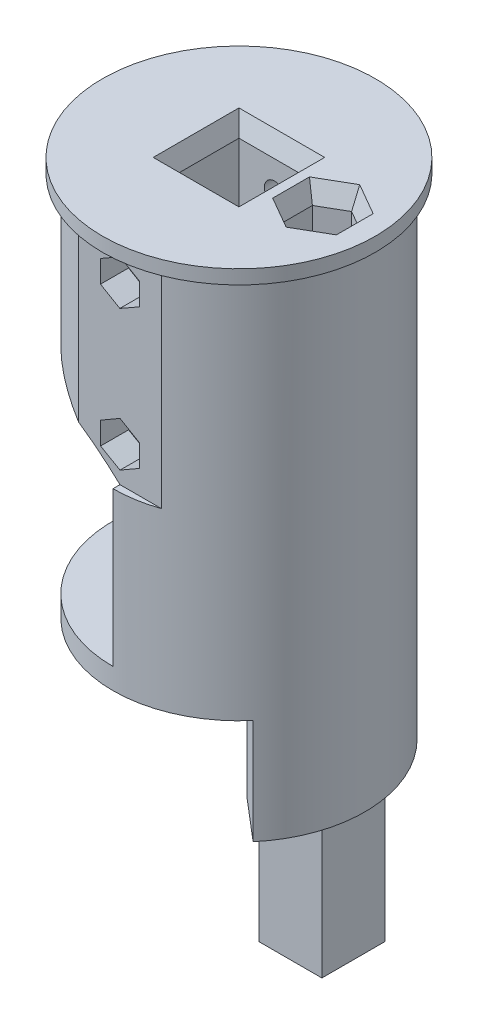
from build123d import *
from build123d.topology import SkipClean

# Parameters (mm, degrees)
SKETCH_1_R          = 18
EXTRUDE_1_DEPTH     = 55
SKETCH_2_R          = 19.5
EXTRUDE_2_DEPTH     = 2
SKETCH_3_W          = 10.25
SKETCH_3_H          = 10.25
CUT_EXTRUDE_1_DEPTH = 40
EXTRUDE_START       = 15
EXTRUDE_3_DEPTH     = 15
BOSS_EXTRUDE1_START = 20
SKETCH1_R           = 18
BOSS_EXTRUDE1_DEPTH = 20
BOSS_EXTRUDE2_START = 7
SKETCH3_R           = 18
BOSS_EXTRUDE2_DEPTH = 7
SKETCH4_W           = 10.2
SKETCH4_H           = 10.2
CUT_EXTRUDE2_DEPTH  = 27
CUT_EXTRUDE4_DEPTH  = 25
BOSS_EXTRUDE3_DEPTH = 3
SKETCH9_W           = 36
SKETCH9_H           = 22
CUT_EXTRUDE5_DEPTH  = 8
SKETCH10_R          = 3.7
SKETCH10_W          = 3
SKETCH10_H          = 2
CUT_EXTRUDE6_DEPTH  = 10
SKETCH11_R          = 2
CUT_EXTRUDE7_DEPTH  = 102
SKETCH15_R          = 18
CUT_EXTRUDE9_DEPTH  = 27
CUT_EXTRUDE11_DEPTH = 30
SKETCH18_R          = 1.5
CUT_EXTRUDE12_DEPTH = 71.437915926
SKETCH19_R          = 3
CUT_EXTRUDE13_DEPTH = 3
BOSS_EXTRUDE5_DEPTH = 22
CUT_EXTRUDE16_DEPTH = 4
CUT_EXTRUDE17_DEPTH = 25.4
CUT_EXTRUDE18_DEPTH = 71.437915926
FILLET2_R           = 5
SKETCH30_W          = 18.8
SKETCH30_H          = 10
CUT_EXTRUDE20_DEPTH = 3
CHAMFER1_SIZE       = 1
CHAMFER1_SIZE2      = 2.747477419
CHAMFER2_SIZE       = 1
CHAMFER2_SIZE2      = 2.747477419
BOSS_EXTRUDE7_START = 20
SKETCH37_W          = 9
SKETCH37_H          = 9
SKETCH37_R          = 2
BOSS_EXTRUDE7_DEPTH = 20
CUT_EXTRUDE22_DEPTH = 15
CUT_EXTRUDE23_REACH = 79.101
SKETCH40_W          = 4.363156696
SKETCH40_H          = 4.363156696
CUT_EXTRUDE24_DEPTH = 10
FILLET7_R           = 6


with BuildPart() as part:
    # Sketch 1 → Extrude 1 (new body)
    with BuildSketch(Plane(origin=(0, 0, 0), x_dir=(1, 0, 0), z_dir=(0, 1, 0))):
        with Locations(Location((0, 0, 0), (0, 0, 270))):
            Circle(SKETCH_1_R)
    extrude(amount=EXTRUDE_1_DEPTH)

    # Sketch 2 → Extrude 2 (add)
    with BuildSketch(Plane(origin=(0, 55, 0), x_dir=(1, 0, 0), z_dir=(0, 1, 0))):
        with Locations(Location((0, 0, 0), (0, 0, 270))):
            Circle(SKETCH_2_R)
    extrude(amount=EXTRUDE_2_DEPTH)

    # Sketch 3 → Cut-Extrude 1 (cut)
    with BuildSketch(Plane(origin=(0, 57, 0), x_dir=(1, 0, 0), z_dir=(0, 1, 0))):
        Rectangle(SKETCH_3_W, SKETCH_3_H)
    extrude(amount=-CUT_EXTRUDE_1_DEPTH, mode=Mode.SUBTRACT)

    # Sketch 4 → Extrude 3 (add)
    with SkipClean():  # the faces are left unmerged after this step: merging them gives an invalid solid
        with BuildSketch(Plane.XZ.offset(EXTRUDE_START)):
            with BuildLine():
                Line((5.142300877, -6.128355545), (11.570176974, -13.788799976))
                ThreePointArc((11.570176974, -13.788799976), (17.937391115, -1.5), (13.69961987, 11.675633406))
                Line((13.69961987, 11.675633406), (5.142300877, 4.38257561))
                Line((5.142300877, 4.38257561), (5.142300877, -6.128355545))
            make_face()
        extrude(amount=-EXTRUDE_3_DEPTH)

    # Sketch1 → Boss-Extrude1 (add)
    with BuildSketch(Plane.XZ.offset(15).offset(BOSS_EXTRUDE1_START)):
        with Locations(Location((0, 0, 0), (0, 0, 270))):
            Circle(SKETCH1_R)
    extrude(amount=-BOSS_EXTRUDE1_DEPTH)

    # Sketch3 → Boss-Extrude2 (add)
    with BuildSketch(Plane.XZ.offset(35).offset(BOSS_EXTRUDE2_START)):
        with Locations(Location((0, 0, 0), (0, 0, 270))):
            Circle(SKETCH3_R)
    extrude(amount=-BOSS_EXTRUDE2_DEPTH)

    # Sketch4 → Cut-Extrude2 (cut)
    with BuildSketch(Plane.XZ.offset(42)):
        Rectangle(SKETCH4_W, SKETCH4_H)
    extrude(amount=-CUT_EXTRUDE2_DEPTH, mode=Mode.SUBTRACT)

    # Sketch6 → Cut-Extrude4 (cut)
    with BuildSketch(Plane.XZ):
        with BuildLine():
            Line((0, 18), (0, -18))
            ThreePointArc((0, -18), (-18, 0), (0, 18))
        make_face()
    extrude(amount=-CUT_EXTRUDE4_DEPTH, mode=Mode.SUBTRACT)

    # Sketch8 → Boss-Extrude3 (add)
    with BuildSketch(Plane.XZ):
        with BuildLine():
            Line((0, -18), (0, 18))
            ThreePointArc((0, 18), (-18, 0), (0, -18))
        make_face()
    extrude(amount=-BOSS_EXTRUDE3_DEPTH)

    # Sketch9 → Cut-Extrude5 (cut)
    with BuildSketch(Plane.ZY):
        with Locations((0, 14)):
            Rectangle(SKETCH9_W, SKETCH9_H)
    extrude(amount=-CUT_EXTRUDE5_DEPTH, mode=Mode.SUBTRACT)

    # Sketch10 → Cut-Extrude6 (cut)
    with BuildSketch(Plane.XZ):
        with Locations(Location((0, 0, 0), (0, 0, 270))):
            Circle(SKETCH10_R)
        with Locations((0, 7.7)):
            Rectangle(SKETCH10_W, SKETCH10_H)
    extrude(amount=-CUT_EXTRUDE6_DEPTH, mode=Mode.SUBTRACT)

    # Sketch11 → Cut-Extrude7 (cut)
    with BuildSketch(Plane.XZ.offset(42)):
        with Locations(Location((12, 0, 0), (0, 0, 270))):
            Circle(SKETCH11_R)
    extrude(amount=-CUT_EXTRUDE7_DEPTH, mode=Mode.SUBTRACT)

    # Sketch15 → Cut-Extrude9 (cut)
    with BuildSketch(Plane.XZ.offset(42)):
        with Locations(Location((0, 0, 0), (0, 0, 310))):
            Circle(SKETCH15_R)
    extrude(amount=-CUT_EXTRUDE9_DEPTH, mode=Mode.SUBTRACT)

    # Sketch17 → Cut-Extrude11 (cut)
    with BuildSketch(Plane.XZ.offset(-25)):
        with BuildLine():
            Line((5.916079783, -17), (-5.916079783, -17))
            ThreePointArc((-5.916079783, -17), (0, -18), (5.916079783, -17))
        make_face()
        with BuildLine():
            Line((5.916079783, 17), (-5.916079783, 17))
            ThreePointArc((-5.916079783, 17), (0, 18), (5.916079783, 17))
        make_face()
    extrude(amount=-CUT_EXTRUDE11_DEPTH, mode=Mode.SUBTRACT)

    # Sketch18 → Cut-Extrude12 (cut, through all)
    with BuildSketch(Plane.XY.offset(-17)):
        with Locations(Location((0, 30, 0), (0, 0, 180))):
            Circle(SKETCH18_R)
        with Locations(Location((0, 50, 0), (0, 0, 180))):
            Circle(SKETCH18_R)
    extrude(amount=CUT_EXTRUDE12_DEPTH, mode=Mode.SUBTRACT)

    # Sketch19 → Cut-Extrude13 (cut)
    with BuildSketch(Plane.XY.offset(-17)):
        with Locations((0, 30)):
            Circle(SKETCH19_R)
        with Locations((0, 50)):
            Circle(SKETCH19_R)
    extrude(amount=CUT_EXTRUDE13_DEPTH, mode=Mode.SUBTRACT)

    # Sketch23 → Boss-Extrude5 (add)
    with BuildSketch(Plane(origin=(0, 3, 0), x_dir=(1, 0, 0), z_dir=(0, 1, 0))):
        with BuildLine():
            Line((0, -14.4), (8, -14.4))
            Line((8, -14.4), (8, -16.124515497))
            ThreePointArc((8, -16.124515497), (4.108449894, -17.524857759), (0, -18))
            Line((0, -18), (0, -14.4))
        make_face()
        with BuildLine():
            Line((0, 14.4), (8, 14.4))
            Line((8, 14.4), (8, 16.124515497))
            ThreePointArc((8, 16.124515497), (4.108449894, 17.524857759), (0, 18))
            Line((0, 18), (0, 14.4))
        make_face()
    extrude(amount=BOSS_EXTRUDE5_DEPTH)

    # Sketch25 → Cut-Extrude16 (cut)
    with BuildSketch(Plane.XY.offset(17)):
        Polygon((2.771281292, 28.4), (2.771281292, 31.6), (0, 33.2), (-2.771281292, 31.6), (-2.771281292, 28.4), (0, 26.8), align=None)
        Polygon((-2.782126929, 48.418933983), (-0.021820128, 46.800074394), (2.760306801, 48.381140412), (2.782126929, 51.581066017), (0.021820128, 53.199925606), (-2.760306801, 51.618859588), align=None)
    extrude(amount=-CUT_EXTRUDE16_DEPTH, mode=Mode.SUBTRACT)

    # Sketch26 → Cut-Extrude17 (cut)
    with BuildSketch(Plane(origin=(0, 57, 0), x_dir=(1, 0, 0), z_dir=(0, 1, 0))):
        Polygon((8.449295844, -2.05), (12, -4.1), (15.550704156, -2.05), (15.550704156, 2.05), (12, 4.1), (8.449295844, 2.05), align=None)
    extrude(amount=-CUT_EXTRUDE17_DEPTH, mode=Mode.SUBTRACT)

    # Sketch27 → Cut-Extrude18 (cut, through all)
    with BuildSketch(Plane.XY.offset(17)):
        with BuildLine():
            Line((-20, 36.547005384), (-20, 25))
            Line((-20, 25), (0, 25))
            ThreePointArc((0, 25), (-9.324199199, 31.944024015), (-20, 36.547005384))
        make_face()
    extrude(amount=-CUT_EXTRUDE18_DEPTH, mode=Mode.SUBTRACT)

    # Fillet2
    fillet2_edges = [part.edges().sort_by_distance(p)[0] for p in [
        (8, 14, -14.4),
        (8, 14, 14.4),
    ]]
    fillet(fillet2_edges, radius=FILLET2_R)

    # Sketch30 → Cut-Extrude20 (cut)
    with BuildSketch(Plane.ZY.offset(-8)):
        with Locations((0, 8)):
            Rectangle(SKETCH30_W, SKETCH30_H)
    extrude(amount=-CUT_EXTRUDE20_DEPTH, mode=Mode.SUBTRACT)

    # Chamfer1
    chamfer1_edges = [part.edges().sort_by_distance(p)[0] for p in [
        (5.125, 57, 0),
        (0, 57, -5.125),
        (-5.125, 57, 0),
        (0, 57, 5.125),
    ]]
    chamfer1_side = [part.faces().sort_by_distance(p)[0] for p in [
        (0, 57, -18.948456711),
    ]]
    chamfer(chamfer1_edges, length=CHAMFER1_SIZE, length2=CHAMFER1_SIZE2, reference=chamfer1_side[0])

    # Chamfer2
    chamfer2_edges = [part.edges().sort_by_distance(p)[0] for p in [
        (8.449295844, 57, 0),
        (10.224647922, 57, 3.075),
        (13.775352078, 57, 3.075),
        (15.550704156, 57, 0),
        (13.775352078, 57, -3.075),
        (10.224647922, 57, -3.075),
    ]]
    chamfer2_side = [part.faces().sort_by_distance(p)[0] for p in [
        (6.676543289, 57, 0),
    ]]
    chamfer(chamfer2_edges, length=CHAMFER2_SIZE, length2=CHAMFER2_SIZE2, reference=chamfer2_side[0])

    # Sketch37 → Boss-Extrude7 (add)
    with BuildSketch(Plane.XZ.offset(15).offset(BOSS_EXTRUDE7_START)):
        with Locations((10.978822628, -0.872889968)):
            Rectangle(SKETCH37_W, SKETCH37_H)
        with Locations(Location((12, 0, 0), (0, 0, 270))):
            Circle(SKETCH37_R, mode=Mode.SUBTRACT)
    extrude(amount=-BOSS_EXTRUDE7_DEPTH)

    # Sketch38 → Cut-Extrude22 (cut)
    with BuildSketch(Plane.XZ.offset(15)):
        with BuildLine():
            Line((5.142300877, -6.128355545), (5.142300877, 4.38257561))
            ThreePointArc((5.142300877, 4.38257561), (5.978822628, -0.872889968), (5.142300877, -6.128355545))
        make_face()
    extrude(amount=-CUT_EXTRUDE22_DEPTH, mode=Mode.SUBTRACT)

    # Cut-Extrude23: up to this face of the body (flat: up to its plane)
    cut_extrude23_end = Plane(part.part.faces().sort_by_distance((9.450359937, 13, 0))[0])
    # Sketch39 → Cut-Extrude23 (cut, up to the picked face)
    with BuildSketch(Plane.XZ.offset(15), mode=Mode.PRIVATE) as cut_extrude23_sk1:
        with BuildLine():
            Line((7.420733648, -7.372889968), (15.420733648, -7.372889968))
            ThreePointArc((15.420733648, -7.372889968), (13.728515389, -10.030415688), (11.598853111, -12.352178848))
            Line((11.598853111, -12.352178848), (7.420733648, -7.372889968))
        make_face()
    cut_extrude23_tool1 = split(extrude(cut_extrude23_sk1.sketch, amount=-CUT_EXTRUDE23_REACH, mode=Mode.PRIVATE), bisect_by=cut_extrude23_end, keep=Keep.BOTH, mode=Mode.PRIVATE)
    add(cut_extrude23_tool1.solids().sort_by(Axis((11.596211, -15, -9.081847), (0, 1, 0)))[0], mode=Mode.SUBTRACT)

    # Sketch40 → Cut-Extrude24 (cut)
    with BuildSketch(Plane(origin=(0, 3, 0), x_dir=(1, 0, 0), z_dir=(0, 1, 0))):
        with Locations((9.602311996, 9.554468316)):
            Rectangle(SKETCH40_W, SKETCH40_H)
    extrude(amount=CUT_EXTRUDE24_DEPTH, mode=Mode.SUBTRACT)

    # Fillet7
    fillet7_edges = [part.edges().sort_by_distance(p)[0] for p in [
        (5.142300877, -7.5, 4.38257561),
        (5.142300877, -7.5, -6.128355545),
    ]]
    fillet(fillet7_edges, radius=FILLET7_R)


solid = part.part
